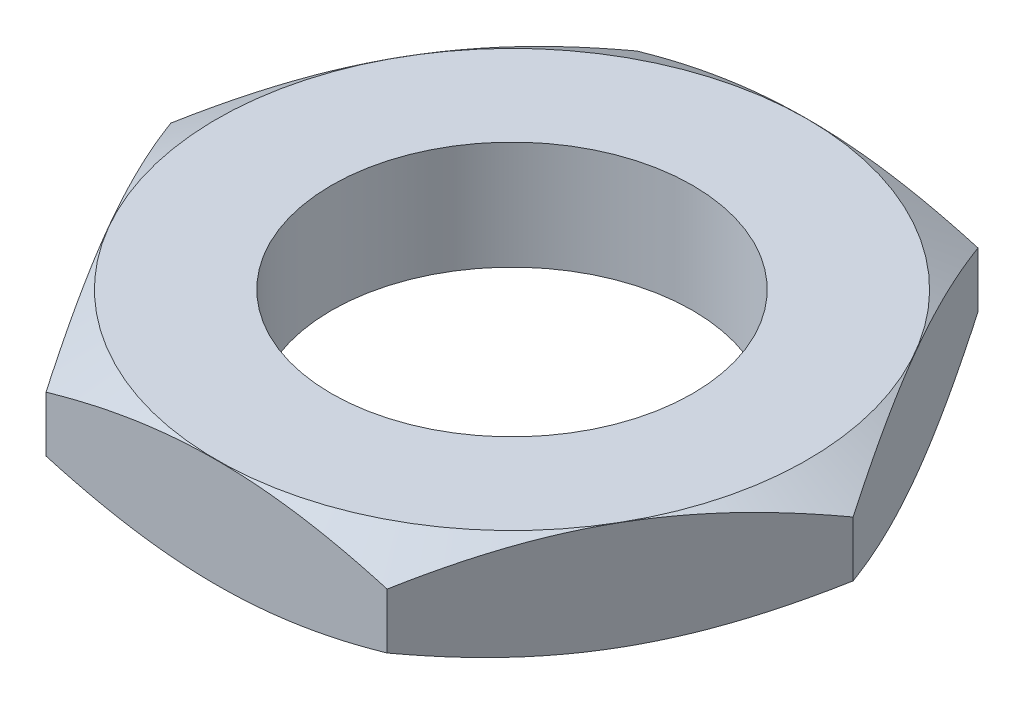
ISO-10303-21;
HEADER;
FILE_DESCRIPTION(('STEP AP214'),'2;1');
FILE_NAME('part.step','',(''),(''),'','','');
FILE_SCHEMA(('AUTOMOTIVE_DESIGN { 1 0 10303 214 1 1 1 1 }'));
ENDSEC;
DATA;
#1=APPLICATION_CONTEXT('core data for automotive mechanical design processes');
#2=APPLICATION_PROTOCOL_DEFINITION('international standard','automotive_design',2000,#1);
#3=PRODUCT_CONTEXT('',#1,'mechanical');
#4=PRODUCT('Part','Part','',(#3));
#5=PRODUCT_RELATED_PRODUCT_CATEGORY('part','',(#4));
#6=PRODUCT_DEFINITION_FORMATION('','',#4);
#7=PRODUCT_DEFINITION_CONTEXT('part definition',#1,'design');
#8=PRODUCT_DEFINITION('design','',#6,#7);
#9=PRODUCT_DEFINITION_SHAPE('','',#8);
#10=(LENGTH_UNIT() NAMED_UNIT(*) SI_UNIT(.MILLI.,.METRE.));
#11=(NAMED_UNIT(*) PLANE_ANGLE_UNIT() SI_UNIT($,.RADIAN.));
#12=(NAMED_UNIT(*) SI_UNIT($,.STERADIAN.) SOLID_ANGLE_UNIT());
#13=UNCERTAINTY_MEASURE_WITH_UNIT(LENGTH_MEASURE(1.E-05),#10,'distance_accuracy_value','');
#14=(GEOMETRIC_REPRESENTATION_CONTEXT(3) GLOBAL_UNCERTAINTY_ASSIGNED_CONTEXT((#13)) GLOBAL_UNIT_ASSIGNED_CONTEXT((#10,
#11,#12)) REPRESENTATION_CONTEXT('',''));
#15=CARTESIAN_POINT('',(0.,0.,0.));
#16=DIRECTION('',(0.,0.,1.));
#17=DIRECTION('',(1.,0.,0.));
#18=AXIS2_PLACEMENT_3D('',#15,#16,#17);
#19=CARTESIAN_POINT('',(4.725,0.,8.18394006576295));
#20=DIRECTION('',(0.,-1.,0.));
#21=DIRECTION('',(0.,0.,-1.));
#22=AXIS2_PLACEMENT_3D('',#19,#20,#21);
#23=PLANE('',#22);
#24=CARTESIAN_POINT('',(0.,0.,0.));
#25=DIRECTION('',(0.,1.,0.));
#26=DIRECTION('',(0.,0.,1.));
#27=AXIS2_PLACEMENT_3D('',#24,#25,#26);
#28=CIRCLE('',#27,5.);
#29=CARTESIAN_POINT('',(0.,0.,5.));
#30=VERTEX_POINT('',#29);
#31=EDGE_CURVE('E109',#30,#30,#28,.T.);
#32=ORIENTED_EDGE('',*,*,#31,.T.);
#33=EDGE_LOOP('',(#32));
#34=FACE_BOUND('',#33,.T.);
#35=CARTESIAN_POINT('',(0.,0.,0.));
#36=DIRECTION('',(0.,-1.,0.));
#37=DIRECTION('',(0.,0.,-1.));
#38=AXIS2_PLACEMENT_3D('',#35,#36,#37);
#39=CIRCLE('',#38,8.18);
#40=CARTESIAN_POINT('',(0.,0.,-8.18));
#41=VERTEX_POINT('',#40);
#42=EDGE_CURVE('E304',#41,#41,#39,.T.);
#43=ORIENTED_EDGE('',*,*,#42,.T.);
#44=EDGE_LOOP('',(#43));
#45=FACE_BOUND('',#44,.T.);
#46=ADVANCED_FACE('F32',(#34,#45),#23,.T.);
#47=CARTESIAN_POINT('',(4.725,3.,8.18394006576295));
#48=DIRECTION('',(0.,-1.,0.));
#49=DIRECTION('',(0.,0.,-1.));
#50=AXIS2_PLACEMENT_3D('',#47,#48,#49);
#51=PLANE('',#50);
#52=CARTESIAN_POINT('',(0.,3.,0.));
#53=DIRECTION('',(0.,-1.,0.));
#54=DIRECTION('',(0.,0.,-1.));
#55=AXIS2_PLACEMENT_3D('',#52,#53,#54);
#56=CIRCLE('',#55,8.18);
#57=CARTESIAN_POINT('',(0.,3.,-8.18));
#58=VERTEX_POINT('',#57);
#59=EDGE_CURVE('E92',#58,#58,#56,.T.);
#60=ORIENTED_EDGE('',*,*,#59,.F.);
#61=EDGE_LOOP('',(#60));
#62=FACE_BOUND('',#61,.T.);
#63=CARTESIAN_POINT('',(0.,3.,0.));
#64=DIRECTION('',(0.,1.,0.));
#65=DIRECTION('',(0.,0.,1.));
#66=AXIS2_PLACEMENT_3D('',#63,#64,#65);
#67=CIRCLE('',#66,5.);
#68=CARTESIAN_POINT('',(0.,3.,5.));
#69=VERTEX_POINT('',#68);
#70=EDGE_CURVE('E205',#69,#69,#67,.T.);
#71=ORIENTED_EDGE('',*,*,#70,.F.);
#72=EDGE_LOOP('',(#71));
#73=FACE_BOUND('',#72,.T.);
#74=ADVANCED_FACE('F214',(#62,#73),#51,.F.);
#75=CARTESIAN_POINT('',(0.,0.,0.));
#76=DIRECTION('',(0.,1.,0.));
#77=DIRECTION('',(0.,0.,1.));
#78=AXIS2_PLACEMENT_3D('',#75,#76,#77);
#79=CYLINDRICAL_SURFACE('',#78,5.);
#80=ORIENTED_EDGE('',*,*,#31,.F.);
#81=EDGE_LOOP('',(#80));
#82=FACE_BOUND('',#81,.T.);
#83=ORIENTED_EDGE('',*,*,#70,.T.);
#84=EDGE_LOOP('',(#83));
#85=FACE_BOUND('',#84,.T.);
#86=ADVANCED_FACE('F151',(#82,#85),#79,.F.);
#87=CARTESIAN_POINT('',(0.,0.,0.));
#88=DIRECTION('',(0.,1.,0.));
#89=DIRECTION('',(0.,0.,1.));
#90=AXIS2_PLACEMENT_3D('',#87,#88,#89);
#91=CONICAL_SURFACE('',#90,8.18,1.0471975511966);
#92=ORIENTED_EDGE('',*,*,#42,.F.);
#93=EDGE_LOOP('',(#92));
#94=FACE_BOUND('',#93,.T.);
#95=CARTESIAN_POINT('',(9.45011547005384,0.733301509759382,-0.000200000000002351));
#96=CARTESIAN_POINT('',(9.34625480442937,0.673346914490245,0.179691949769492));
#97=CARTESIAN_POINT('',(9.24200690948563,0.616113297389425,0.36025460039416));
#98=CARTESIAN_POINT('',(9.03266449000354,0.507837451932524,0.722846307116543));
#99=CARTESIAN_POINT('',(8.92756962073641,0.456797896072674,0.904875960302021));
#100=CARTESIAN_POINT('',(8.61060232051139,0.313972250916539,1.45387942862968));
#101=CARTESIAN_POINT('',(8.39747867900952,0.232734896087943,1.82302040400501));
#102=CARTESIAN_POINT('',(8.07854326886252,0.137474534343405,2.37543273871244));
#103=CARTESIAN_POINT('',(7.97368430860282,0.110337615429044,2.5570537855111));
#104=CARTESIAN_POINT('',(7.76349218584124,0.0648336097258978,2.92111722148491));
#105=CARTESIAN_POINT('',(7.65815906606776,0.0464657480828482,3.1035595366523));
#106=CARTESIAN_POINT('',(7.44731146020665,0.0189653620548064,3.468758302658));
#107=CARTESIAN_POINT('',(7.3417973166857,0.0098223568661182,3.6515141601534));
#108=CARTESIAN_POINT('',(7.13067155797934,0.000967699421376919,4.01719470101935));
#109=CARTESIAN_POINT('',(7.02505994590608,0.00125575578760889,4.20011937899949));
#110=CARTESIAN_POINT('',(6.82761523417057,0.0106072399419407,4.54210365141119));
#111=CARTESIAN_POINT('',(6.7357682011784,0.0185299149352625,4.70118737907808));
#112=CARTESIAN_POINT('',(6.55228925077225,0.0413544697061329,5.01898224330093));
#113=CARTESIAN_POINT('',(6.46065734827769,0.0562568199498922,5.17769335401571));
#114=CARTESIAN_POINT('',(6.18611638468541,0.111081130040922,5.65321225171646));
#115=CARTESIAN_POINT('',(6.00369328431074,0.161113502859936,5.96917833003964));
#116=CARTESIAN_POINT('',(5.6369119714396,0.286195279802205,6.60446219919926));
#117=CARTESIAN_POINT('',(5.45260056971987,0.361774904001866,6.92369891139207));
#118=CARTESIAN_POINT('',(5.08672633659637,0.533309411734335,7.55741167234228));
#119=CARTESIAN_POINT('',(4.90515881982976,0.62922400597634,7.87189583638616));
#120=CARTESIAN_POINT('',(4.72488452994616,0.733301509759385,8.18414006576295));
#121=B_SPLINE_CURVE_WITH_KNOTS('',3,(#95,#96,#97,#98,#99,#100,#101,#102,#103,#104,#105,#106,
#107,#108,#109,#110,#111,#112,#113,#114,#115,#116,#117,#118,#119,#120),.UNSPECIFIED.,.F.,.F.,(4,
2,2,2,2,2,2,2,2,2,2,2,4),(0.,0.648550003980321,1.29737884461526,2.59773234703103,
3.23198376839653,3.86617913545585,4.49965314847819,5.13310758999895,5.68456465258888,
6.23605889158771,7.33983294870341,8.46808657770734,9.59412536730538),.UNSPECIFIED.);
#122=CARTESIAN_POINT('',(9.45,0.733234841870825,0.));
#123=VERTEX_POINT('',#122);
#124=CARTESIAN_POINT('',(4.725,0.733234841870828,8.18394006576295));
#125=VERTEX_POINT('',#124);
#126=EDGE_CURVE('E56',#123,#125,#121,.T.);
#127=ORIENTED_EDGE('',*,*,#126,.T.);
#128=CARTESIAN_POINT('',(-12.5753497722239,3.9397666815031,8.18394006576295));
#129=CARTESIAN_POINT('',(-12.2188659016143,3.76731212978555,8.18394006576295));
#130=CARTESIAN_POINT('',(-11.861551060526,3.59654523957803,8.18394006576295));
#131=CARTESIAN_POINT('',(-11.1448170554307,3.25933838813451,8.18394006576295));
#132=CARTESIAN_POINT('',(-10.7853975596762,3.09289913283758,8.18394006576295));
#133=CARTESIAN_POINT('',(-10.0621033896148,2.76443665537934,8.18394006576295));
#134=CARTESIAN_POINT('',(-9.69821503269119,2.60244345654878,8.18394006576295));
#135=CARTESIAN_POINT('',(-8.96750300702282,2.28524408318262,8.18394006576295));
#136=CARTESIAN_POINT('',(-8.60067948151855,2.13003757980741,8.18394006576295));
#137=CARTESIAN_POINT('',(-7.85212858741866,1.82354589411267,8.18394006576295));
#138=CARTESIAN_POINT('',(-7.47029056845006,1.67252943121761,8.18394006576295));
#139=CARTESIAN_POINT('',(-6.70210533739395,1.38221090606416,8.18394006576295));
#140=CARTESIAN_POINT('',(-6.31575761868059,1.24291017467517,8.18394006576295));
#141=CARTESIAN_POINT('',(-5.53869534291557,0.97976629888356,8.18394006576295));
#142=CARTESIAN_POINT('',(-5.14799185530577,0.855890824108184,8.18394006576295));
#143=CARTESIAN_POINT('',(-4.36099669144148,0.627647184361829,8.18394006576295));
#144=CARTESIAN_POINT('',(-3.96470685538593,0.523272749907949,8.18394006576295));
#145=CARTESIAN_POINT('',(-3.16842594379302,0.339672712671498,8.18394006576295));
#146=CARTESIAN_POINT('',(-2.76846616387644,0.260315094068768,8.18394006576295));
#147=CARTESIAN_POINT('',(-2.16497946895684,0.163533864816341,8.18394006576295));
#148=CARTESIAN_POINT('',(-1.96321030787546,0.134981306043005,8.18394006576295));
#149=CARTESIAN_POINT('',(-1.55870924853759,0.0858570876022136,8.18394006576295));
#150=CARTESIAN_POINT('',(-1.3559774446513,0.065284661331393,8.18394006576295));
#151=CARTESIAN_POINT('',(-0.952419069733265,0.0327825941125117,8.18394006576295));
#152=CARTESIAN_POINT('',(-0.751601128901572,0.0207461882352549,8.18394006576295));
#153=CARTESIAN_POINT('',(-0.349636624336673,0.00516769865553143,8.18394006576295));
#154=CARTESIAN_POINT('',(-0.148490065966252,0.00162547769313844,8.18394006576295));
#155=CARTESIAN_POINT('',(0.253773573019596,0.0031196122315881,8.18394006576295));
#156=CARTESIAN_POINT('',(0.454890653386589,0.00815603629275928,8.18394006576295));
#157=CARTESIAN_POINT('',(0.856737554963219,0.0266866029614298,8.18394006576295));
#158=CARTESIAN_POINT('',(1.05746735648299,0.0401811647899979,8.18394006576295));
#159=CARTESIAN_POINT('',(1.5434798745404,0.0828126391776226,8.18394006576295));
#160=CARTESIAN_POINT('',(1.82839930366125,0.116162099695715,8.18394006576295));
#161=CARTESIAN_POINT('',(2.39604752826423,0.198057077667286,8.18394006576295));
#162=CARTESIAN_POINT('',(2.67877600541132,0.246604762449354,8.18394006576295));
#163=CARTESIAN_POINT('',(3.24179936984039,0.357168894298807,8.18394006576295));
#164=CARTESIAN_POINT('',(3.52209210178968,0.419196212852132,8.18394006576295));
#165=CARTESIAN_POINT('',(4.07982912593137,0.554833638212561,8.18394006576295));
#166=CARTESIAN_POINT('',(4.35727346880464,0.62844353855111,8.18394006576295));
#167=CARTESIAN_POINT('',(4.91532510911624,0.787176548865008,8.18394006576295));
#168=CARTESIAN_POINT('',(5.19587092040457,0.872514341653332,8.18394006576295));
#169=CARTESIAN_POINT('',(5.75419801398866,1.05175395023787,8.18394006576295));
#170=CARTESIAN_POINT('',(6.03197927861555,1.14565582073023,8.18394006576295));
#171=CARTESIAN_POINT('',(6.58491879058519,1.34055497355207,8.18394006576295));
#172=CARTESIAN_POINT('',(6.86007793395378,1.44154972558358,8.18394006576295));
#173=CARTESIAN_POINT('',(7.40813349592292,1.64947142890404,8.18394006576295));
#174=CARTESIAN_POINT('',(7.68102993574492,1.75639832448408,8.18394006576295));
#175=CARTESIAN_POINT('',(8.30213899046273,2.00630638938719,8.18394006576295));
#176=CARTESIAN_POINT('',(8.64970393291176,2.15089439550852,8.18394006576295));
#177=CARTESIAN_POINT('',(9.34206149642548,2.44657896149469,8.18394006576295));
#178=CARTESIAN_POINT('',(9.68685397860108,2.59767584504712,8.18394006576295));
#179=CARTESIAN_POINT('',(10.3741543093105,2.90513511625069,8.18394006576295));
#180=CARTESIAN_POINT('',(10.7166617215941,3.06149847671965,8.18394006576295));
#181=CARTESIAN_POINT('',(11.3996909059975,3.37848001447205,8.18394006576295));
#182=CARTESIAN_POINT('',(11.7402127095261,3.53909812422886,8.18394006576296));
#183=CARTESIAN_POINT('',(12.4198863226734,3.86397153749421,8.18394006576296));
#184=CARTESIAN_POINT('',(12.7590366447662,4.02822994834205,8.18394006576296));
#185=CARTESIAN_POINT('',(13.4359166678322,4.35965060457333,8.18394006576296));
#186=CARTESIAN_POINT('',(13.7736463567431,4.52681287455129,8.18394006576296));
#187=CARTESIAN_POINT('',(14.7850441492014,5.03192181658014,8.18394006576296));
#188=CARTESIAN_POINT('',(15.4569074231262,5.37348409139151,8.18394006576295));
#189=CARTESIAN_POINT('',(16.4357878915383,5.87747532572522,8.18394006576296));
#190=CARTESIAN_POINT('',(16.7442084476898,6.03719546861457,8.18394006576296));
#191=CARTESIAN_POINT('',(17.3603777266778,6.35791500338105,8.18394006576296));
#192=CARTESIAN_POINT('',(17.6681264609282,6.51891437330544,8.18394006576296));
#193=CARTESIAN_POINT('',(18.5905201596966,7.0035885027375,8.18394006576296));
#194=CARTESIAN_POINT('',(19.2042903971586,7.32892780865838,8.18394006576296));
#195=CARTESIAN_POINT('',(20.4286482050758,7.98228636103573,8.18394006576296));
#196=CARTESIAN_POINT('',(21.0392398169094,8.31029804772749,8.18394006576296));
#197=CARTESIAN_POINT('',(22.2589298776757,8.9690153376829,8.18394006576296));
#198=CARTESIAN_POINT('',(22.8680283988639,9.29972080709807,8.18394006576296));
#199=CARTESIAN_POINT('',(23.4765704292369,9.63144067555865,8.18394006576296));
#200=B_SPLINE_CURVE_WITH_KNOTS('',3,(#128,#129,#130,#131,#132,#133,#134,#135,#136,#137,#138,
#139,#140,#141,#142,#143,#144,#145,#146,#147,#148,#149,#150,#151,#152,#153,#154,#155,#156,#157,
#158,#159,#160,#161,#162,#163,#164,#165,#166,#167,#168,#169,#170,#171,#172,#173,#174,#175,#176,
#177,#178,#179,#180,#181,#182,#183,#184,#185,#186,#187,#188,#189,#190,#191,#192,#193,#194,#195,
#196,#197,#198,#199),.UNSPECIFIED.,.F.,.F.,(4,2,2,2,2,2,2,2,2,2,2,2,2,2,2,2,2,2,2,2,2,2,2,2,2,2,
2,2,2,2,2,2,2,2,2,4),(0.,1.1880352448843,2.37626308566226,3.57115900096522,4.76599695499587,
5.99769859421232,7.22953996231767,8.45875438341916,9.68757293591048,10.9097939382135,
11.5209990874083,12.1321455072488,12.7355063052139,13.3388573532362,13.9422132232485,
14.5455990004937,15.4057140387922,16.2659517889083,17.1268859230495,17.9878047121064,
18.8673545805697,19.7469100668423,20.626153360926,21.5053883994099,22.6346207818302,
23.7639093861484,24.8934077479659,26.0228881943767,27.1533730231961,28.2838674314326,
30.5449013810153,31.5868714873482,32.6288237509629,34.7128033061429,36.7921529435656,
38.8713998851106),.UNSPECIFIED.);
#201=CARTESIAN_POINT('',(-4.725,0.733234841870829,8.18394006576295));
#202=VERTEX_POINT('',#201);
#203=EDGE_CURVE('E83',#125,#202,#200,.F.);
#204=ORIENTED_EDGE('',*,*,#203,.T.);
#205=CARTESIAN_POINT('',(-4.72488452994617,0.733301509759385,8.18414006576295));
#206=CARTESIAN_POINT('',(-4.82874519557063,0.673346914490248,8.00424811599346));
#207=CARTESIAN_POINT('',(-4.93299309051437,0.616113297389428,7.82368546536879));
#208=CARTESIAN_POINT('',(-5.14233550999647,0.507837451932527,7.46109375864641));
#209=CARTESIAN_POINT('',(-5.2474303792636,0.456797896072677,7.27906410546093));
#210=CARTESIAN_POINT('',(-5.56439767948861,0.313972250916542,6.73006063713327));
#211=CARTESIAN_POINT('',(-5.77752132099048,0.232734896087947,6.36091966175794));
#212=CARTESIAN_POINT('',(-6.09645673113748,0.137474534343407,5.80850732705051));
#213=CARTESIAN_POINT('',(-6.20131569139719,0.110337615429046,5.62688628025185));
#214=CARTESIAN_POINT('',(-6.41150781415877,0.0648336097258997,5.26282284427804));
#215=CARTESIAN_POINT('',(-6.51684093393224,0.0464657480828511,5.08038052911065));
#216=CARTESIAN_POINT('',(-6.72768853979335,0.0189653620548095,4.71518176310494));
#217=CARTESIAN_POINT('',(-6.8332026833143,0.00982235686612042,4.53242590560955));
#218=CARTESIAN_POINT('',(-7.04432844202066,0.000967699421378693,4.1667453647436));
#219=CARTESIAN_POINT('',(-7.14994005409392,0.00125575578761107,3.98382068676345));
#220=CARTESIAN_POINT('',(-7.34738476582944,0.010607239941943,3.64183641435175));
#221=CARTESIAN_POINT('',(-7.43923179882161,0.0185299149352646,3.48275268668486));
#222=CARTESIAN_POINT('',(-7.62271074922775,0.0413544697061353,3.16495782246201));
#223=CARTESIAN_POINT('',(-7.71434265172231,0.0562568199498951,3.00624671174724));
#224=CARTESIAN_POINT('',(-7.98888361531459,0.111081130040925,2.53072781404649));
#225=CARTESIAN_POINT('',(-8.17130671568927,0.161113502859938,2.21476173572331));
#226=CARTESIAN_POINT('',(-8.53808802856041,0.286195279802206,1.57947786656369));
#227=CARTESIAN_POINT('',(-8.72239943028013,0.361774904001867,1.26024115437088));
#228=CARTESIAN_POINT('',(-9.08827366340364,0.533309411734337,0.626528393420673));
#229=CARTESIAN_POINT('',(-9.26984118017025,0.629224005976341,0.312044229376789));
#230=CARTESIAN_POINT('',(-9.45011547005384,0.733301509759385,-0.000200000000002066));
#231=B_SPLINE_CURVE_WITH_KNOTS('',3,(#205,#206,#207,#208,#209,#210,#211,#212,#213,#214,#215,
#216,#217,#218,#219,#220,#221,#222,#223,#224,#225,#226,#227,#228,#229,#230),.UNSPECIFIED.,.F.,
.F.,(4,2,2,2,2,2,2,2,2,2,2,2,4),(0.,0.648550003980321,1.29737884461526,2.59773234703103,
3.23198376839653,3.86617913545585,4.49965314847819,5.13310758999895,5.68456465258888,
6.23605889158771,7.33983294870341,8.46808657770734,9.59412536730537),.UNSPECIFIED.);
#232=CARTESIAN_POINT('',(-9.45,0.733234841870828,0.));
#233=VERTEX_POINT('',#232);
#234=EDGE_CURVE('E86',#202,#233,#231,.T.);
#235=ORIENTED_EDGE('',*,*,#234,.T.);
#236=CARTESIAN_POINT('',(-9.45011547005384,0.733301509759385,0.000199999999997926));
#237=CARTESIAN_POINT('',(-9.34625480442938,0.673346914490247,-0.179691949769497));
#238=CARTESIAN_POINT('',(-9.24200690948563,0.616113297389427,-0.360254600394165));
#239=CARTESIAN_POINT('',(-9.03266449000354,0.507837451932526,-0.722846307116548));
#240=CARTESIAN_POINT('',(-8.92756962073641,0.456797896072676,-0.904875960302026));
#241=CARTESIAN_POINT('',(-8.6106023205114,0.31397225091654,-1.45387942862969));
#242=CARTESIAN_POINT('',(-8.39747867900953,0.232734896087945,-1.82302040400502));
#243=CARTESIAN_POINT('',(-8.07854326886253,0.137474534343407,-2.37543273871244));
#244=CARTESIAN_POINT('',(-7.97368430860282,0.110337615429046,-2.5570537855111));
#245=CARTESIAN_POINT('',(-7.76349218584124,0.0648336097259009,-2.92111722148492));
#246=CARTESIAN_POINT('',(-7.65815906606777,0.0464657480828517,-3.1035595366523));
#247=CARTESIAN_POINT('',(-7.44731146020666,0.0189653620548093,-3.46875830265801));
#248=CARTESIAN_POINT('',(-7.34179731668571,0.00982235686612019,-3.65151416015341));
#249=CARTESIAN_POINT('',(-7.13067155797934,0.000967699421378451,-4.01719470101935));
#250=CARTESIAN_POINT('',(-7.02505994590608,0.00125575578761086,-4.2001193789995));
#251=CARTESIAN_POINT('',(-6.82761523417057,0.010607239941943,-4.5421036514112));
#252=CARTESIAN_POINT('',(-6.7357682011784,0.0185299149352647,-4.70118737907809));
#253=CARTESIAN_POINT('',(-6.55228925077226,0.0413544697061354,-5.01898224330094));
#254=CARTESIAN_POINT('',(-6.4606573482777,0.056256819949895,-5.17769335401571));
#255=CARTESIAN_POINT('',(-6.18611638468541,0.111081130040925,-5.65321225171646));
#256=CARTESIAN_POINT('',(-6.00369328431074,0.161113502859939,-5.96917833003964));
#257=CARTESIAN_POINT('',(-5.6369119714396,0.286195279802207,-6.60446219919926));
#258=CARTESIAN_POINT('',(-5.45260056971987,0.361774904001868,-6.92369891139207));
#259=CARTESIAN_POINT('',(-5.08672633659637,0.533309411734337,-7.55741167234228));
#260=CARTESIAN_POINT('',(-4.90515881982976,0.62922400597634,-7.87189583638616));
#261=CARTESIAN_POINT('',(-4.72488452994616,0.733301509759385,-8.18414006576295));
#262=B_SPLINE_CURVE_WITH_KNOTS('',3,(#236,#237,#238,#239,#240,#241,#242,#243,#244,#245,#246,
#247,#248,#249,#250,#251,#252,#253,#254,#255,#256,#257,#258,#259,#260,#261),.UNSPECIFIED.,.F.,
.F.,(4,2,2,2,2,2,2,2,2,2,2,2,4),(0.,0.648550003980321,1.29737884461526,2.59773234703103,
3.23198376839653,3.86617913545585,4.49965314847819,5.13310758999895,5.68456465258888,
6.2360588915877,7.33983294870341,8.46808657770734,9.59412536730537),.UNSPECIFIED.);
#263=CARTESIAN_POINT('',(-4.725,0.733234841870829,-8.18394006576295));
#264=VERTEX_POINT('',#263);
#265=EDGE_CURVE('E101',#233,#264,#262,.T.);
#266=ORIENTED_EDGE('',*,*,#265,.T.);
#267=CARTESIAN_POINT('',(-12.5753497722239,3.9397666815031,-8.18394006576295));
#268=CARTESIAN_POINT('',(-12.2188659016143,3.76731212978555,-8.18394006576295));
#269=CARTESIAN_POINT('',(-11.861551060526,3.59654523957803,-8.18394006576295));
#270=CARTESIAN_POINT('',(-11.1448170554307,3.25933838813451,-8.18394006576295));
#271=CARTESIAN_POINT('',(-10.7853975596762,3.09289913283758,-8.18394006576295));
#272=CARTESIAN_POINT('',(-10.0621033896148,2.76443665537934,-8.18394006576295));
#273=CARTESIAN_POINT('',(-9.69821503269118,2.60244345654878,-8.18394006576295));
#274=CARTESIAN_POINT('',(-8.96750300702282,2.28524408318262,-8.18394006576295));
#275=CARTESIAN_POINT('',(-8.60067948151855,2.13003757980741,-8.18394006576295));
#276=CARTESIAN_POINT('',(-7.85212858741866,1.82354589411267,-8.18394006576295));
#277=CARTESIAN_POINT('',(-7.47029056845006,1.67252943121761,-8.18394006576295));
#278=CARTESIAN_POINT('',(-6.70210533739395,1.38221090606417,-8.18394006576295));
#279=CARTESIAN_POINT('',(-6.31575761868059,1.24291017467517,-8.18394006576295));
#280=CARTESIAN_POINT('',(-5.53869534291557,0.979766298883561,-8.18394006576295));
#281=CARTESIAN_POINT('',(-5.14799185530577,0.855890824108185,-8.18394006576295));
#282=CARTESIAN_POINT('',(-4.36099669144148,0.627647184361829,-8.18394006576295));
#283=CARTESIAN_POINT('',(-3.96470685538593,0.523272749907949,-8.18394006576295));
#284=CARTESIAN_POINT('',(-3.16842594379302,0.339672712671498,-8.18394006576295));
#285=CARTESIAN_POINT('',(-2.76846616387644,0.260315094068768,-8.18394006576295));
#286=CARTESIAN_POINT('',(-2.16497946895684,0.163533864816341,-8.18394006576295));
#287=CARTESIAN_POINT('',(-1.96321030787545,0.134981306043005,-8.18394006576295));
#288=CARTESIAN_POINT('',(-1.55870924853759,0.0858570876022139,-8.18394006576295));
#289=CARTESIAN_POINT('',(-1.3559774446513,0.0652846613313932,-8.18394006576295));
#290=CARTESIAN_POINT('',(-0.952419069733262,0.032782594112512,-8.18394006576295));
#291=CARTESIAN_POINT('',(-0.751601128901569,0.020746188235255,-8.18394006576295));
#292=CARTESIAN_POINT('',(-0.34963662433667,0.0051676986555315,-8.18394006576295));
#293=CARTESIAN_POINT('',(-0.148490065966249,0.00162547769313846,-8.18394006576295));
#294=CARTESIAN_POINT('',(0.2537735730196,0.00311961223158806,-8.18394006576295));
#295=CARTESIAN_POINT('',(0.454890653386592,0.00815603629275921,-8.18394006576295));
#296=CARTESIAN_POINT('',(0.856737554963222,0.0266866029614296,-8.18394006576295));
#297=CARTESIAN_POINT('',(1.057467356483,0.0401811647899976,-8.18394006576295));
#298=CARTESIAN_POINT('',(1.54347987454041,0.0828126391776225,-8.18394006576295));
#299=CARTESIAN_POINT('',(1.82839930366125,0.116162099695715,-8.18394006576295));
#300=CARTESIAN_POINT('',(2.39604752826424,0.198057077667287,-8.18394006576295));
#301=CARTESIAN_POINT('',(2.67877600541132,0.246604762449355,-8.18394006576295));
#302=CARTESIAN_POINT('',(3.24179936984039,0.357168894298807,-8.18394006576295));
#303=CARTESIAN_POINT('',(3.52209210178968,0.419196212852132,-8.18394006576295));
#304=CARTESIAN_POINT('',(4.07982912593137,0.554833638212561,-8.18394006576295));
#305=CARTESIAN_POINT('',(4.35727346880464,0.62844353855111,-8.18394006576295));
#306=CARTESIAN_POINT('',(4.91532510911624,0.787176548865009,-8.18394006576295));
#307=CARTESIAN_POINT('',(5.19587092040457,0.872514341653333,-8.18394006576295));
#308=CARTESIAN_POINT('',(5.75419801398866,1.05175395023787,-8.18394006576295));
#309=CARTESIAN_POINT('',(6.03197927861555,1.14565582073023,-8.18394006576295));
#310=CARTESIAN_POINT('',(6.58491879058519,1.34055497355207,-8.18394006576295));
#311=CARTESIAN_POINT('',(6.86007793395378,1.44154972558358,-8.18394006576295));
#312=CARTESIAN_POINT('',(7.40813349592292,1.64947142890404,-8.18394006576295));
#313=CARTESIAN_POINT('',(7.68102993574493,1.75639832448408,-8.18394006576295));
#314=CARTESIAN_POINT('',(8.30213899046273,2.00630638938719,-8.18394006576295));
#315=CARTESIAN_POINT('',(8.64970393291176,2.15089439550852,-8.18394006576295));
#316=CARTESIAN_POINT('',(9.34206149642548,2.44657896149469,-8.18394006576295));
#317=CARTESIAN_POINT('',(9.68685397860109,2.59767584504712,-8.18394006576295));
#318=CARTESIAN_POINT('',(10.3741543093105,2.90513511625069,-8.18394006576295));
#319=CARTESIAN_POINT('',(10.7166617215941,3.06149847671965,-8.18394006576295));
#320=CARTESIAN_POINT('',(11.3996909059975,3.37848001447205,-8.18394006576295));
#321=CARTESIAN_POINT('',(11.7402127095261,3.53909812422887,-8.18394006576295));
#322=CARTESIAN_POINT('',(12.4198863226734,3.86397153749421,-8.18394006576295));
#323=CARTESIAN_POINT('',(12.7590366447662,4.02822994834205,-8.18394006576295));
#324=CARTESIAN_POINT('',(13.4359166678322,4.35965060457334,-8.18394006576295));
#325=CARTESIAN_POINT('',(13.7736463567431,4.52681287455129,-8.18394006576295));
#326=CARTESIAN_POINT('',(14.7850441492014,5.03192181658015,-8.18394006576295));
#327=CARTESIAN_POINT('',(15.4569074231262,5.37348409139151,-8.18394006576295));
#328=CARTESIAN_POINT('',(16.4357878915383,5.87747532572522,-8.18394006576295));
#329=CARTESIAN_POINT('',(16.7442084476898,6.03719546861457,-8.18394006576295));
#330=CARTESIAN_POINT('',(17.3603777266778,6.35791500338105,-8.18394006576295));
#331=CARTESIAN_POINT('',(17.6681264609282,6.51891437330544,-8.18394006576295));
#332=CARTESIAN_POINT('',(18.5905201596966,7.0035885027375,-8.18394006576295));
#333=CARTESIAN_POINT('',(19.2042903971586,7.32892780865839,-8.18394006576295));
#334=CARTESIAN_POINT('',(20.4286482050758,7.98228636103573,-8.18394006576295));
#335=CARTESIAN_POINT('',(21.0392398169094,8.31029804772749,-8.18394006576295));
#336=CARTESIAN_POINT('',(22.2589298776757,8.9690153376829,-8.18394006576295));
#337=CARTESIAN_POINT('',(22.8680283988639,9.29972080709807,-8.18394006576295));
#338=CARTESIAN_POINT('',(23.4765704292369,9.63144067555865,-8.18394006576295));
#339=B_SPLINE_CURVE_WITH_KNOTS('',3,(#267,#268,#269,#270,#271,#272,#273,#274,#275,#276,#277,
#278,#279,#280,#281,#282,#283,#284,#285,#286,#287,#288,#289,#290,#291,#292,#293,#294,#295,#296,
#297,#298,#299,#300,#301,#302,#303,#304,#305,#306,#307,#308,#309,#310,#311,#312,#313,#314,#315,
#316,#317,#318,#319,#320,#321,#322,#323,#324,#325,#326,#327,#328,#329,#330,#331,#332,#333,#334,
#335,#336,#337,#338),.UNSPECIFIED.,.F.,.F.,(4,2,2,2,2,2,2,2,2,2,2,2,2,2,2,2,2,2,2,2,2,2,2,2,2,2,
2,2,2,2,2,2,2,2,2,4),(0.,1.1880352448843,2.37626308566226,3.57115900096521,4.76599695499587,
5.99769859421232,7.22953996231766,8.45875438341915,9.68757293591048,10.9097939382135,
11.5209990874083,12.1321455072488,12.7355063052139,13.3388573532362,13.9422132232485,
14.5455990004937,15.4057140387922,16.2659517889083,17.1268859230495,17.9878047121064,
18.8673545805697,19.7469100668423,20.626153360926,21.5053883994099,22.6346207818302,
23.7639093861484,24.8934077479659,26.0228881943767,27.1533730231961,28.2838674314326,
30.5449013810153,31.5868714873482,32.6288237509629,34.7128033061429,36.7921529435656,
38.8713998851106),.UNSPECIFIED.);
#340=CARTESIAN_POINT('',(4.725,0.733234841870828,-8.18394006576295));
#341=VERTEX_POINT('',#340);
#342=EDGE_CURVE('E121',#264,#341,#339,.T.);
#343=ORIENTED_EDGE('',*,*,#342,.T.);
#344=CARTESIAN_POINT('',(4.72488452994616,0.733301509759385,-8.18414006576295));
#345=CARTESIAN_POINT('',(4.82874519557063,0.673346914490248,-8.00424811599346));
#346=CARTESIAN_POINT('',(4.93299309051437,0.616113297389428,-7.82368546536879));
#347=CARTESIAN_POINT('',(5.14233550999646,0.507837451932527,-7.46109375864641));
#348=CARTESIAN_POINT('',(5.24743037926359,0.456797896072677,-7.27906410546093));
#349=CARTESIAN_POINT('',(5.56439767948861,0.313972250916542,-6.73006063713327));
#350=CARTESIAN_POINT('',(5.77752132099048,0.232734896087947,-6.36091966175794));
#351=CARTESIAN_POINT('',(6.09645673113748,0.137474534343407,-5.80850732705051));
#352=CARTESIAN_POINT('',(6.20131569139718,0.110337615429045,-5.62688628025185));
#353=CARTESIAN_POINT('',(6.41150781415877,0.0648336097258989,-5.26282284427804));
#354=CARTESIAN_POINT('',(6.51684093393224,0.0464657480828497,-5.08038052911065));
#355=CARTESIAN_POINT('',(6.72768853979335,0.0189653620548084,-4.71518176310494));
#356=CARTESIAN_POINT('',(6.8332026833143,0.00982235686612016,-4.53242590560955));
#357=CARTESIAN_POINT('',(7.04432844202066,0.000967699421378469,-4.1667453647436));
#358=CARTESIAN_POINT('',(7.14994005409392,0.00125575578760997,-3.98382068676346));
#359=CARTESIAN_POINT('',(7.34738476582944,0.0106072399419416,-3.64183641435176));
#360=CARTESIAN_POINT('',(7.43923179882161,0.0185299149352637,-3.48275268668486));
#361=CARTESIAN_POINT('',(7.62271074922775,0.0413544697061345,-3.16495782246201));
#362=CARTESIAN_POINT('',(7.71434265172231,0.056256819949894,-3.00624671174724));
#363=CARTESIAN_POINT('',(7.98888361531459,0.111081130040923,-2.53072781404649));
#364=CARTESIAN_POINT('',(8.17130671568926,0.161113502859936,-2.21476173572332));
#365=CARTESIAN_POINT('',(8.5380880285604,0.286195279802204,-1.57947786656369));
#366=CARTESIAN_POINT('',(8.72239943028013,0.361774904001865,-1.26024115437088));
#367=CARTESIAN_POINT('',(9.08827366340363,0.533309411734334,-0.626528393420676));
#368=CARTESIAN_POINT('',(9.26984118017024,0.629224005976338,-0.312044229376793));
#369=CARTESIAN_POINT('',(9.45011547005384,0.733301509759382,0.000199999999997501));
#370=B_SPLINE_CURVE_WITH_KNOTS('',3,(#344,#345,#346,#347,#348,#349,#350,#351,#352,#353,#354,
#355,#356,#357,#358,#359,#360,#361,#362,#363,#364,#365,#366,#367,#368,#369),.UNSPECIFIED.,.F.,
.F.,(4,2,2,2,2,2,2,2,2,2,2,2,4),(0.,0.648550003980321,1.29737884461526,2.59773234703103,
3.23198376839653,3.86617913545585,4.4996531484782,5.13310758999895,5.68456465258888,
6.23605889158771,7.33983294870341,8.46808657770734,9.59412536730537),.UNSPECIFIED.);
#371=EDGE_CURVE('E129',#341,#123,#370,.T.);
#372=ORIENTED_EDGE('',*,*,#371,.T.);
#373=EDGE_LOOP('',(#127,#204,#235,#266,#343,#372));
#374=FACE_BOUND('',#373,.T.);
#375=ADVANCED_FACE('F85',(#94,#374),#91,.T.);
#376=CARTESIAN_POINT('',(0.,3.,0.));
#377=DIRECTION('',(0.,-1.,0.));
#378=DIRECTION('',(0.,0.,-1.));
#379=AXIS2_PLACEMENT_3D('',#376,#377,#378);
#380=CONICAL_SURFACE('',#379,8.18,1.0471975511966);
#381=ORIENTED_EDGE('',*,*,#59,.T.);
#382=EDGE_LOOP('',(#381));
#383=FACE_BOUND('',#382,.T.);
#384=CARTESIAN_POINT('',(4.72488452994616,2.26669849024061,-8.18414006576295));
#385=CARTESIAN_POINT('',(4.82874519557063,2.32665308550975,-8.00424811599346));
#386=CARTESIAN_POINT('',(4.93299309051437,2.38388670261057,-7.82368546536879));
#387=CARTESIAN_POINT('',(5.14233550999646,2.49216254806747,-7.46109375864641));
#388=CARTESIAN_POINT('',(5.2474303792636,2.54320210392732,-7.27906410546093));
#389=CARTESIAN_POINT('',(5.56439767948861,2.68602774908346,-6.73006063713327));
#390=CARTESIAN_POINT('',(5.77752132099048,2.76726510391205,-6.36091966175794));
#391=CARTESIAN_POINT('',(6.09645673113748,2.86252546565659,-5.80850732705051));
#392=CARTESIAN_POINT('',(6.20131569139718,2.88966238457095,-5.62688628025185));
#393=CARTESIAN_POINT('',(6.41150781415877,2.9351663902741,-5.26282284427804));
#394=CARTESIAN_POINT('',(6.51684093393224,2.95353425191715,-5.08038052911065));
#395=CARTESIAN_POINT('',(6.72768853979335,2.98103463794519,-4.71518176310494));
#396=CARTESIAN_POINT('',(6.8332026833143,2.99017764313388,-4.53242590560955));
#397=CARTESIAN_POINT('',(7.04432844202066,2.99903230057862,-4.1667453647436));
#398=CARTESIAN_POINT('',(7.14994005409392,2.99874424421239,-3.98382068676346));
#399=CARTESIAN_POINT('',(7.34738476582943,2.98939276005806,-3.64183641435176));
#400=CARTESIAN_POINT('',(7.4392317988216,2.98147008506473,-3.48275268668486));
#401=CARTESIAN_POINT('',(7.62271074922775,2.95864553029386,-3.16495782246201));
#402=CARTESIAN_POINT('',(7.71434265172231,2.94374318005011,-3.00624671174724));
#403=CARTESIAN_POINT('',(7.98888361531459,2.88891886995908,-2.53072781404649));
#404=CARTESIAN_POINT('',(8.17130671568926,2.83888649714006,-2.21476173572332));
#405=CARTESIAN_POINT('',(8.5380880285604,2.71380472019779,-1.57947786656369));
#406=CARTESIAN_POINT('',(8.72239943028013,2.63822509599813,-1.26024115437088));
#407=CARTESIAN_POINT('',(9.08827366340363,2.46669058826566,-0.626528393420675));
#408=CARTESIAN_POINT('',(9.26984118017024,2.37077599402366,-0.312044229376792));
#409=CARTESIAN_POINT('',(9.45011547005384,2.26669849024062,0.000199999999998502));
#410=B_SPLINE_CURVE_WITH_KNOTS('',3,(#384,#385,#386,#387,#388,#389,#390,#391,#392,#393,#394,
#395,#396,#397,#398,#399,#400,#401,#402,#403,#404,#405,#406,#407,#408,#409),.UNSPECIFIED.,.F.,
.F.,(4,2,2,2,2,2,2,2,2,2,2,2,4),(0.,0.64855000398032,1.29737884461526,2.59773234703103,
3.23198376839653,3.86617913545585,4.49965314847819,5.13310758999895,5.68456465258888,
6.23605889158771,7.33983294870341,8.46808657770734,9.59412536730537),.UNSPECIFIED.);
#411=CARTESIAN_POINT('',(4.725,2.26676515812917,-8.18394006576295));
#412=VERTEX_POINT('',#411);
#413=CARTESIAN_POINT('',(9.45,2.26676515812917,0.));
#414=VERTEX_POINT('',#413);
#415=EDGE_CURVE('E127',#412,#414,#410,.T.);
#416=ORIENTED_EDGE('',*,*,#415,.F.);
#417=CARTESIAN_POINT('',(-12.5696647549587,-0.937015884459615,-8.18394006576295));
#418=CARTESIAN_POINT('',(-12.2132264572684,-0.764606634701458,-8.18394006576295));
#419=CARTESIAN_POINT('',(-11.8559566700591,-0.59388629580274,-8.18394006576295));
#420=CARTESIAN_POINT('',(-11.1393114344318,-0.256775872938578,-8.18394006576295));
#421=CARTESIAN_POINT('',(-10.779935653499,-0.0903864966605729,-8.18394006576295));
#422=CARTESIAN_POINT('',(-10.0567247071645,0.23797305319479,-8.18394006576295));
#423=CARTESIAN_POINT('',(-9.69287583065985,0.399913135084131,-8.18394006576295));
#424=CARTESIAN_POINT('',(-8.9622410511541,0.717000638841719,-8.18394006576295));
#425=CARTESIAN_POINT('',(-8.59545529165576,0.872148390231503,-8.18394006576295));
#426=CARTESIAN_POINT('',(-7.8470032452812,1.17850356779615,-8.18394006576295));
#427=CARTESIAN_POINT('',(-7.46522648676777,1.32944262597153,-8.18394006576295));
#428=CARTESIAN_POINT('',(-6.69716241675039,1.61959816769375,-8.18394006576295));
#429=CARTESIAN_POINT('',(-6.31087459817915,1.75881331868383,-8.18394006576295));
#430=CARTESIAN_POINT('',(-5.53393266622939,2.02177591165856,-8.18394006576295));
#431=CARTESIAN_POINT('',(-5.14328964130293,2.1455557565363,-8.18394006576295));
#432=CARTESIAN_POINT('',(-4.35641646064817,2.37359737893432,-8.18394006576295));
#433=CARTESIAN_POINT('',(-3.96018814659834,2.47786543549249,-8.18394006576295));
#434=CARTESIAN_POINT('',(-3.16402940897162,2.66124439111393,-8.18394006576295));
#435=CARTESIAN_POINT('',(-2.76413019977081,2.74048709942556,-8.18394006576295));
#436=CARTESIAN_POINT('',(-2.16073965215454,2.83709171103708,-8.18394006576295));
#437=CARTESIAN_POINT('',(-1.95900337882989,2.86558468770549,-8.18394006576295));
#438=CARTESIAN_POINT('',(-1.55457024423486,2.91458938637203,-8.18394006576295));
#439=CARTESIAN_POINT('',(-1.35187347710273,2.93510187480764,-8.18394006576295));
#440=CARTESIAN_POINT('',(-0.94838427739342,2.96748593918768,-8.18394006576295));
#441=CARTESIAN_POINT('',(-0.747600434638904,2.97946415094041,-8.18394006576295));
#442=CARTESIAN_POINT('',(-0.345706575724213,2.99492823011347,-8.18394006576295));
#443=CARTESIAN_POINT('',(-0.144596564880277,2.99841423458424,-8.18394006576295));
#444=CARTESIAN_POINT('',(0.257591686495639,2.99681098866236,-8.18394006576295));
#445=CARTESIAN_POINT('',(0.458669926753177,2.99172166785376,-8.18394006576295));
#446=CARTESIAN_POINT('',(0.860437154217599,2.97308980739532,-8.18394006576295));
#447=CARTESIAN_POINT('',(1.06112612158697,2.95954684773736,-8.18394006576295));
#448=CARTESIAN_POINT('',(1.54721800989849,2.91678865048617,-8.18394006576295));
#449=CARTESIAN_POINT('',(1.83225594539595,2.88335317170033,-8.18394006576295));
#450=CARTESIAN_POINT('',(2.40013647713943,2.80128023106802,-8.18394006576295));
#451=CARTESIAN_POINT('',(2.68297875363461,2.75264059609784,-8.18394006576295));
#452=CARTESIAN_POINT('',(3.24622622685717,2.64188992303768,-8.18394006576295));
#453=CARTESIAN_POINT('',(3.52662926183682,2.57976799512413,-8.18394006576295));
#454=CARTESIAN_POINT('',(4.08458397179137,2.44394124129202,-8.18394006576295));
#455=CARTESIAN_POINT('',(4.36213569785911,2.37023662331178,-8.18394006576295));
#456=CARTESIAN_POINT('',(4.92039864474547,2.21131460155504,-8.18394006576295));
#457=CARTESIAN_POINT('',(5.20104837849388,2.12588268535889,-8.18394006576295));
#458=CARTESIAN_POINT('',(5.75958227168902,1.94645726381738,-8.18394006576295));
#459=CARTESIAN_POINT('',(6.03746641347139,1.85246370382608,-8.18394006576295));
#460=CARTESIAN_POINT('',(6.59061090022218,1.65738398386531,-8.18394006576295));
#461=CARTESIAN_POINT('',(6.86587214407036,1.5563003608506,-8.18394006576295));
#462=CARTESIAN_POINT('',(7.41413188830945,1.348203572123,-8.18394006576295));
#463=CARTESIAN_POINT('',(7.68713040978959,1.24119046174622,-8.18394006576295));
#464=CARTESIAN_POINT('',(8.30784563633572,0.991340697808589,-8.18394006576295));
#465=CARTESIAN_POINT('',(8.65492062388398,0.846912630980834,-8.18394006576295));
#466=CARTESIAN_POINT('',(9.3463079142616,0.551572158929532,-8.18394006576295));
#467=CARTESIAN_POINT('',(9.69062007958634,0.400659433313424,-8.18394006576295));
#468=CARTESIAN_POINT('',(10.3769669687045,0.0935864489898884,-8.18394006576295));
#469=CARTESIAN_POINT('',(10.7190012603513,-0.0625747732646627,-8.18394006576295));
#470=CARTESIAN_POINT('',(11.401090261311,-0.379138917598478,-8.18394006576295));
#471=CARTESIAN_POINT('',(11.7411450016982,-0.539541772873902,-8.18394006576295));
#472=CARTESIAN_POINT('',(12.419887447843,-0.863974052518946,-8.18394006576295));
#473=CARTESIAN_POINT('',(12.7585736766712,-1.02800656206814,-8.18394006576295));
#474=CARTESIAN_POINT('',(13.4345291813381,-1.35896797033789,-8.18394006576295));
#475=CARTESIAN_POINT('',(13.7717984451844,-1.52589689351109,-8.18394006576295));
#476=CARTESIAN_POINT('',(14.7818191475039,-2.03029737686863,-8.18394006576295));
#477=CARTESIAN_POINT('',(15.452770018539,-2.37137615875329,-8.18394006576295));
#478=CARTESIAN_POINT('',(16.4303773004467,-2.8746795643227,-8.18394006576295));
#479=CARTESIAN_POINT('',(16.7384341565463,-3.03420080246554,-8.18394006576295));
#480=CARTESIAN_POINT('',(17.353877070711,-3.35452067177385,-8.18394006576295));
#481=CARTESIAN_POINT('',(17.6612631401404,-3.51531928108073,-8.18394006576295));
#482=CARTESIAN_POINT('',(18.5825699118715,-3.99938885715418,-8.18394006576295));
#483=CARTESIAN_POINT('',(19.1956171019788,-4.32432217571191,-8.18394006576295));
#484=CARTESIAN_POINT('',(20.418537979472,-4.97686882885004,-8.18394006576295));
#485=CARTESIAN_POINT('',(21.0284156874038,-5.30447464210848,-8.18394006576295));
#486=CARTESIAN_POINT('',(22.2466795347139,-5.96237777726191,-8.18394006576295));
#487=CARTESIAN_POINT('',(22.855065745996,-6.29267496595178,-8.18394006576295));
#488=CARTESIAN_POINT('',(23.4628958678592,-6.62398589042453,-8.18394006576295));
#489=B_SPLINE_CURVE_WITH_KNOTS('',3,(#417,#418,#419,#420,#421,#422,#423,#424,#425,#426,#427,
#428,#429,#430,#431,#432,#433,#434,#435,#436,#437,#438,#439,#440,#441,#442,#443,#444,#445,#446,
#447,#448,#449,#450,#451,#452,#453,#454,#455,#456,#457,#458,#459,#460,#461,#462,#463,#464,#465,
#466,#467,#468,#469,#470,#471,#472,#473,#474,#475,#476,#477,#478,#479,#480,#481,#482,#483,#484,
#485,#486,#487,#488),.UNSPECIFIED.,.F.,.F.,(4,2,2,2,2,2,2,2,2,2,2,2,2,2,2,2,2,2,2,2,2,2,2,2,2,2,
2,2,2,2,2,2,2,2,2,4),(0.,1.18785301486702,2.37589892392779,3.57062173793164,4.76528652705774,
5.99673164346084,7.22831653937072,8.45727084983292,9.68582899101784,10.9078039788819,
11.5188863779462,12.1299100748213,12.7331583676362,13.3363969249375,13.9396404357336,
14.5429139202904,15.4034117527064,16.2640326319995,17.1253512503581,17.986654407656,
18.8665848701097,19.746520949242,20.6261437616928,21.5057583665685,22.6334499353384,
23.7611972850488,24.8891528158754,26.0170905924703,27.1460270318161,28.2749730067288,
30.5329098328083,31.573636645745,32.6143456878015,34.6958383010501,36.7727250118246,
38.8495095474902),.UNSPECIFIED.);
#490=CARTESIAN_POINT('',(-4.725,2.26676515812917,-8.18394006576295));
#491=VERTEX_POINT('',#490);
#492=EDGE_CURVE('E122',#491,#412,#489,.T.);
#493=ORIENTED_EDGE('',*,*,#492,.F.);
#494=CARTESIAN_POINT('',(-9.45011547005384,2.26669849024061,0.000199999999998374));
#495=CARTESIAN_POINT('',(-9.34625480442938,2.32665308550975,-0.179691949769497));
#496=CARTESIAN_POINT('',(-9.24200690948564,2.38388670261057,-0.360254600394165));
#497=CARTESIAN_POINT('',(-9.03266449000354,2.49216254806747,-0.722846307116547));
#498=CARTESIAN_POINT('',(-8.92756962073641,2.54320210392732,-0.904875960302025));
#499=CARTESIAN_POINT('',(-8.6106023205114,2.68602774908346,-1.45387942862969));
#500=CARTESIAN_POINT('',(-8.39747867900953,2.76726510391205,-1.82302040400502));
#501=CARTESIAN_POINT('',(-8.07854326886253,2.86252546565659,-2.37543273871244));
#502=CARTESIAN_POINT('',(-7.97368430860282,2.88966238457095,-2.5570537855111));
#503=CARTESIAN_POINT('',(-7.76349218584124,2.9351663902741,-2.92111722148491));
#504=CARTESIAN_POINT('',(-7.65815906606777,2.95353425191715,-3.1035595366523));
#505=CARTESIAN_POINT('',(-7.44731146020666,2.98103463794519,-3.46875830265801));
#506=CARTESIAN_POINT('',(-7.34179731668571,2.99017764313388,-3.6515141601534));
#507=CARTESIAN_POINT('',(-7.13067155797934,2.99903230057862,-4.01719470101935));
#508=CARTESIAN_POINT('',(-7.02505994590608,2.99874424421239,-4.2001193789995));
#509=CARTESIAN_POINT('',(-6.82761523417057,2.98939276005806,-4.5421036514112));
#510=CARTESIAN_POINT('',(-6.7357682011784,2.98147008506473,-4.70118737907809));
#511=CARTESIAN_POINT('',(-6.55228925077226,2.95864553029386,-5.01898224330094));
#512=CARTESIAN_POINT('',(-6.4606573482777,2.9437431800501,-5.17769335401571));
#513=CARTESIAN_POINT('',(-6.18611638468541,2.88891886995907,-5.65321225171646));
#514=CARTESIAN_POINT('',(-6.00369328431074,2.83888649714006,-5.96917833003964));
#515=CARTESIAN_POINT('',(-5.6369119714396,2.71380472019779,-6.60446219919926));
#516=CARTESIAN_POINT('',(-5.45260056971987,2.63822509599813,-6.92369891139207));
#517=CARTESIAN_POINT('',(-5.08672633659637,2.46669058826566,-7.55741167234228));
#518=CARTESIAN_POINT('',(-4.90515881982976,2.37077599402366,-7.87189583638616));
#519=CARTESIAN_POINT('',(-4.72488452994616,2.26669849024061,-8.18414006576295));
#520=B_SPLINE_CURVE_WITH_KNOTS('',3,(#494,#495,#496,#497,#498,#499,#500,#501,#502,#503,#504,
#505,#506,#507,#508,#509,#510,#511,#512,#513,#514,#515,#516,#517,#518,#519),.UNSPECIFIED.,.F.,
.F.,(4,2,2,2,2,2,2,2,2,2,2,2,4),(0.,0.64855000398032,1.29737884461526,2.59773234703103,
3.23198376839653,3.86617913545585,4.49965314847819,5.13310758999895,5.68456465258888,
6.23605889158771,7.33983294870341,8.46808657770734,9.59412536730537),.UNSPECIFIED.);
#521=CARTESIAN_POINT('',(-9.45,2.26676515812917,0.));
#522=VERTEX_POINT('',#521);
#523=EDGE_CURVE('E181',#522,#491,#520,.T.);
#524=ORIENTED_EDGE('',*,*,#523,.F.);
#525=CARTESIAN_POINT('',(-4.72488452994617,2.26669849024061,8.18414006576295));
#526=CARTESIAN_POINT('',(-4.82874519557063,2.32665308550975,8.00424811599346));
#527=CARTESIAN_POINT('',(-4.93299309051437,2.38388670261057,7.82368546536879));
#528=CARTESIAN_POINT('',(-5.14233550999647,2.49216254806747,7.46109375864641));
#529=CARTESIAN_POINT('',(-5.2474303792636,2.54320210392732,7.27906410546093));
#530=CARTESIAN_POINT('',(-5.56439767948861,2.68602774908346,6.73006063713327));
#531=CARTESIAN_POINT('',(-5.77752132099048,2.76726510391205,6.36091966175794));
#532=CARTESIAN_POINT('',(-6.09645673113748,2.86252546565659,5.80850732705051));
#533=CARTESIAN_POINT('',(-6.20131569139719,2.88966238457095,5.62688628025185));
#534=CARTESIAN_POINT('',(-6.41150781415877,2.9351663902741,5.26282284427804));
#535=CARTESIAN_POINT('',(-6.51684093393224,2.95353425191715,5.08038052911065));
#536=CARTESIAN_POINT('',(-6.72768853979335,2.98103463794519,4.71518176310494));
#537=CARTESIAN_POINT('',(-6.8332026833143,2.99017764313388,4.53242590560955));
#538=CARTESIAN_POINT('',(-7.04432844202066,2.99903230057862,4.1667453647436));
#539=CARTESIAN_POINT('',(-7.14994005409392,2.99874424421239,3.98382068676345));
#540=CARTESIAN_POINT('',(-7.34738476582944,2.98939276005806,3.64183641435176));
#541=CARTESIAN_POINT('',(-7.43923179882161,2.98147008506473,3.48275268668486));
#542=CARTESIAN_POINT('',(-7.62271074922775,2.95864553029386,3.16495782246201));
#543=CARTESIAN_POINT('',(-7.71434265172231,2.9437431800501,3.00624671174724));
#544=CARTESIAN_POINT('',(-7.98888361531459,2.88891886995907,2.53072781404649));
#545=CARTESIAN_POINT('',(-8.17130671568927,2.83888649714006,2.21476173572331));
#546=CARTESIAN_POINT('',(-8.53808802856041,2.71380472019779,1.57947786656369));
#547=CARTESIAN_POINT('',(-8.72239943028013,2.63822509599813,1.26024115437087));
#548=CARTESIAN_POINT('',(-9.08827366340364,2.46669058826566,0.626528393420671));
#549=CARTESIAN_POINT('',(-9.26984118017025,2.37077599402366,0.312044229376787));
#550=CARTESIAN_POINT('',(-9.45011547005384,2.26669849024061,-0.000200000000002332));
#551=B_SPLINE_CURVE_WITH_KNOTS('',3,(#525,#526,#527,#528,#529,#530,#531,#532,#533,#534,#535,
#536,#537,#538,#539,#540,#541,#542,#543,#544,#545,#546,#547,#548,#549,#550),.UNSPECIFIED.,.F.,
.F.,(4,2,2,2,2,2,2,2,2,2,2,2,4),(0.,0.648550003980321,1.29737884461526,2.59773234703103,
3.23198376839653,3.86617913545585,4.49965314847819,5.13310758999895,5.68456465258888,
6.23605889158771,7.33983294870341,8.46808657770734,9.59412536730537),.UNSPECIFIED.);
#552=CARTESIAN_POINT('',(-4.725,2.26676515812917,8.18394006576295));
#553=VERTEX_POINT('',#552);
#554=EDGE_CURVE('E48',#553,#522,#551,.T.);
#555=ORIENTED_EDGE('',*,*,#554,.F.);
#556=CARTESIAN_POINT('',(-12.5696647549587,-0.937015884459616,8.18394006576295));
#557=CARTESIAN_POINT('',(-12.2132264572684,-0.764606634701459,8.18394006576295));
#558=CARTESIAN_POINT('',(-11.8559566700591,-0.59388629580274,8.18394006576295));
#559=CARTESIAN_POINT('',(-11.1393114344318,-0.256775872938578,8.18394006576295));
#560=CARTESIAN_POINT('',(-10.779935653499,-0.090386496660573,8.18394006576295));
#561=CARTESIAN_POINT('',(-10.0567247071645,0.237973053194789,8.18394006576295));
#562=CARTESIAN_POINT('',(-9.69287583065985,0.399913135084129,8.18394006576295));
#563=CARTESIAN_POINT('',(-8.96224105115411,0.717000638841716,8.18394006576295));
#564=CARTESIAN_POINT('',(-8.59545529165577,0.872148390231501,8.18394006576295));
#565=CARTESIAN_POINT('',(-7.84700324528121,1.17850356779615,8.18394006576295));
#566=CARTESIAN_POINT('',(-7.46522648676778,1.32944262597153,8.18394006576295));
#567=CARTESIAN_POINT('',(-6.6971624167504,1.61959816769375,8.18394006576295));
#568=CARTESIAN_POINT('',(-6.31087459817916,1.75881331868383,8.18394006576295));
#569=CARTESIAN_POINT('',(-5.53393266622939,2.02177591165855,8.18394006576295));
#570=CARTESIAN_POINT('',(-5.14328964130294,2.1455557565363,8.18394006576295));
#571=CARTESIAN_POINT('',(-4.35641646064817,2.37359737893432,8.18394006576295));
#572=CARTESIAN_POINT('',(-3.96018814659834,2.47786543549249,8.18394006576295));
#573=CARTESIAN_POINT('',(-3.16402940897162,2.66124439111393,8.18394006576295));
#574=CARTESIAN_POINT('',(-2.76413019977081,2.74048709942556,8.18394006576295));
#575=CARTESIAN_POINT('',(-2.16073965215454,2.83709171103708,8.18394006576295));
#576=CARTESIAN_POINT('',(-1.95900337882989,2.86558468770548,8.18394006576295));
#577=CARTESIAN_POINT('',(-1.55457024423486,2.91458938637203,8.18394006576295));
#578=CARTESIAN_POINT('',(-1.35187347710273,2.93510187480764,8.18394006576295));
#579=CARTESIAN_POINT('',(-0.948384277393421,2.96748593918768,8.18394006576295));
#580=CARTESIAN_POINT('',(-0.747600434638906,2.97946415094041,8.18394006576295));
#581=CARTESIAN_POINT('',(-0.345706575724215,2.99492823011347,8.18394006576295));
#582=CARTESIAN_POINT('',(-0.144596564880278,2.99841423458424,8.18394006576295));
#583=CARTESIAN_POINT('',(0.257591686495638,2.99681098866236,8.18394006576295));
#584=CARTESIAN_POINT('',(0.458669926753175,2.99172166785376,8.18394006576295));
#585=CARTESIAN_POINT('',(0.860437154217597,2.97308980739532,8.18394006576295));
#586=CARTESIAN_POINT('',(1.06112612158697,2.95954684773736,8.18394006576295));
#587=CARTESIAN_POINT('',(1.54721800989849,2.91678865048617,8.18394006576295));
#588=CARTESIAN_POINT('',(1.83225594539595,2.88335317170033,8.18394006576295));
#589=CARTESIAN_POINT('',(2.40013647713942,2.80128023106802,8.18394006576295));
#590=CARTESIAN_POINT('',(2.68297875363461,2.75264059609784,8.18394006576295));
#591=CARTESIAN_POINT('',(3.24622622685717,2.64188992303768,8.18394006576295));
#592=CARTESIAN_POINT('',(3.52662926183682,2.57976799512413,8.18394006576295));
#593=CARTESIAN_POINT('',(4.08458397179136,2.44394124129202,8.18394006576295));
#594=CARTESIAN_POINT('',(4.36213569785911,2.37023662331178,8.18394006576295));
#595=CARTESIAN_POINT('',(4.92039864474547,2.21131460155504,8.18394006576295));
#596=CARTESIAN_POINT('',(5.20104837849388,2.12588268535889,8.18394006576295));
#597=CARTESIAN_POINT('',(5.75958227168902,1.94645726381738,8.18394006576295));
#598=CARTESIAN_POINT('',(6.03746641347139,1.85246370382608,8.18394006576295));
#599=CARTESIAN_POINT('',(6.59061090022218,1.65738398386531,8.18394006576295));
#600=CARTESIAN_POINT('',(6.86587214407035,1.5563003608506,8.18394006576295));
#601=CARTESIAN_POINT('',(7.41413188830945,1.348203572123,8.18394006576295));
#602=CARTESIAN_POINT('',(7.68713040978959,1.24119046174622,8.18394006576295));
#603=CARTESIAN_POINT('',(8.30784563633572,0.991340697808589,8.18394006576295));
#604=CARTESIAN_POINT('',(8.65492062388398,0.846912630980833,8.18394006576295));
#605=CARTESIAN_POINT('',(9.3463079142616,0.551572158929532,8.18394006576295));
#606=CARTESIAN_POINT('',(9.69062007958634,0.400659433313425,8.18394006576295));
#607=CARTESIAN_POINT('',(10.3769669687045,0.0935864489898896,8.18394006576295));
#608=CARTESIAN_POINT('',(10.7190012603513,-0.0625747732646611,8.18394006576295));
#609=CARTESIAN_POINT('',(11.401090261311,-0.379138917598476,8.18394006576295));
#610=CARTESIAN_POINT('',(11.7411450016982,-0.5395417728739,8.18394006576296));
#611=CARTESIAN_POINT('',(12.419887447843,-0.863974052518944,8.18394006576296));
#612=CARTESIAN_POINT('',(12.7585736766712,-1.02800656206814,8.18394006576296));
#613=CARTESIAN_POINT('',(13.4345291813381,-1.35896797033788,8.18394006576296));
#614=CARTESIAN_POINT('',(13.7717984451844,-1.52589689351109,8.18394006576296));
#615=CARTESIAN_POINT('',(14.7818191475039,-2.03029737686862,8.18394006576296));
#616=CARTESIAN_POINT('',(15.452770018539,-2.37137615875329,8.18394006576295));
#617=CARTESIAN_POINT('',(16.4303773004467,-2.87467956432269,8.18394006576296));
#618=CARTESIAN_POINT('',(16.7384341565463,-3.03420080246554,8.18394006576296));
#619=CARTESIAN_POINT('',(17.353877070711,-3.35452067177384,8.18394006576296));
#620=CARTESIAN_POINT('',(17.6612631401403,-3.51531928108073,8.18394006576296));
#621=CARTESIAN_POINT('',(18.5825699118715,-3.99938885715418,8.18394006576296));
#622=CARTESIAN_POINT('',(19.1956171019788,-4.32432217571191,8.18394006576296));
#623=CARTESIAN_POINT('',(20.418537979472,-4.97686882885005,8.18394006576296));
#624=CARTESIAN_POINT('',(21.0284156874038,-5.30447464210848,8.18394006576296));
#625=CARTESIAN_POINT('',(22.2466795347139,-5.96237777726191,8.18394006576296));
#626=CARTESIAN_POINT('',(22.855065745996,-6.29267496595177,8.18394006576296));
#627=CARTESIAN_POINT('',(23.4628958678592,-6.62398589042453,8.18394006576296));
#628=B_SPLINE_CURVE_WITH_KNOTS('',3,(#556,#557,#558,#559,#560,#561,#562,#563,#564,#565,#566,
#567,#568,#569,#570,#571,#572,#573,#574,#575,#576,#577,#578,#579,#580,#581,#582,#583,#584,#585,
#586,#587,#588,#589,#590,#591,#592,#593,#594,#595,#596,#597,#598,#599,#600,#601,#602,#603,#604,
#605,#606,#607,#608,#609,#610,#611,#612,#613,#614,#615,#616,#617,#618,#619,#620,#621,#622,#623,
#624,#625,#626,#627),.UNSPECIFIED.,.F.,.F.,(4,2,2,2,2,2,2,2,2,2,2,2,2,2,2,2,2,2,2,2,2,2,2,2,2,2,
2,2,2,2,2,2,2,2,2,4),(0.,1.18785301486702,2.37589892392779,3.57062173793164,4.76528652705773,
5.99673164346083,7.22831653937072,8.45727084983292,9.68582899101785,10.9078039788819,
11.5188863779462,12.1299100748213,12.7331583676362,13.3363969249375,13.9396404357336,
14.5429139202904,15.4034117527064,16.2640326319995,17.1253512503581,17.986654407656,
18.8665848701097,19.7465209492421,20.6261437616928,21.5057583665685,22.6334499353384,
23.7611972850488,24.8891528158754,26.0170905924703,27.1460270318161,28.2749730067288,
30.5329098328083,31.573636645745,32.6143456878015,34.6958383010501,36.7727250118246,
38.8495095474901),.UNSPECIFIED.);
#629=CARTESIAN_POINT('',(4.725,2.26676515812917,8.18394006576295));
#630=VERTEX_POINT('',#629);
#631=EDGE_CURVE('E104',#630,#553,#628,.F.);
#632=ORIENTED_EDGE('',*,*,#631,.F.);
#633=CARTESIAN_POINT('',(9.45011547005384,2.26669849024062,-0.000200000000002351));
#634=CARTESIAN_POINT('',(9.34625480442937,2.32665308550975,0.179691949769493));
#635=CARTESIAN_POINT('',(9.24200690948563,2.38388670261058,0.36025460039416));
#636=CARTESIAN_POINT('',(9.03266449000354,2.49216254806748,0.722846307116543));
#637=CARTESIAN_POINT('',(8.92756962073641,2.54320210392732,0.904875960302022));
#638=CARTESIAN_POINT('',(8.61060232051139,2.68602774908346,1.45387942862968));
#639=CARTESIAN_POINT('',(8.39747867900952,2.76726510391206,1.82302040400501));
#640=CARTESIAN_POINT('',(8.07854326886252,2.86252546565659,2.37543273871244));
#641=CARTESIAN_POINT('',(7.97368430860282,2.88966238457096,2.5570537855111));
#642=CARTESIAN_POINT('',(7.76349218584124,2.9351663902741,2.92111722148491));
#643=CARTESIAN_POINT('',(7.65815906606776,2.95353425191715,3.1035595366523));
#644=CARTESIAN_POINT('',(7.44731146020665,2.98103463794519,3.468758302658));
#645=CARTESIAN_POINT('',(7.3417973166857,2.99017764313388,3.6515141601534));
#646=CARTESIAN_POINT('',(7.13067155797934,2.99903230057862,4.01719470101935));
#647=CARTESIAN_POINT('',(7.02505994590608,2.99874424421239,4.20011937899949));
#648=CARTESIAN_POINT('',(6.82761523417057,2.98939276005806,4.54210365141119));
#649=CARTESIAN_POINT('',(6.7357682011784,2.98147008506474,4.70118737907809));
#650=CARTESIAN_POINT('',(6.55228925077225,2.95864553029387,5.01898224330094));
#651=CARTESIAN_POINT('',(6.46065734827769,2.94374318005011,5.17769335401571));
#652=CARTESIAN_POINT('',(6.18611638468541,2.88891886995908,5.65321225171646));
#653=CARTESIAN_POINT('',(6.00369328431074,2.83888649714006,5.96917833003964));
#654=CARTESIAN_POINT('',(5.6369119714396,2.71380472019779,6.60446219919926));
#655=CARTESIAN_POINT('',(5.45260056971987,2.63822509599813,6.92369891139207));
#656=CARTESIAN_POINT('',(5.08672633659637,2.46669058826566,7.55741167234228));
#657=CARTESIAN_POINT('',(4.90515881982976,2.37077599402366,7.87189583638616));
#658=CARTESIAN_POINT('',(4.72488452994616,2.26669849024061,8.18414006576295));
#659=B_SPLINE_CURVE_WITH_KNOTS('',3,(#633,#634,#635,#636,#637,#638,#639,#640,#641,#642,#643,
#644,#645,#646,#647,#648,#649,#650,#651,#652,#653,#654,#655,#656,#657,#658),.UNSPECIFIED.,.F.,
.F.,(4,2,2,2,2,2,2,2,2,2,2,2,4),(0.,0.648550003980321,1.29737884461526,2.59773234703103,
3.23198376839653,3.86617913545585,4.49965314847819,5.13310758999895,5.68456465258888,
6.23605889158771,7.33983294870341,8.46808657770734,9.59412536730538),.UNSPECIFIED.);
#660=EDGE_CURVE('E199',#414,#630,#659,.T.);
#661=ORIENTED_EDGE('',*,*,#660,.F.);
#662=EDGE_LOOP('',(#416,#493,#524,#555,#632,#661));
#663=FACE_BOUND('',#662,.T.);
#664=ADVANCED_FACE('F150',(#383,#663),#380,.T.);
#665=CARTESIAN_POINT('',(-4.725,3.,8.18394006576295));
#666=DIRECTION('',(0.,0.,-1.));
#667=DIRECTION('',(-1.,0.,0.));
#668=AXIS2_PLACEMENT_3D('',#665,#666,#667);
#669=PLANE('',#668);
#670=DIRECTION('',(0.,-1.,0.));
#671=VECTOR('',#670,1.);
#672=CARTESIAN_POINT('',(4.725,3.,8.18394006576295));
#673=LINE('',#672,#671);
#674=EDGE_CURVE('E105',#630,#125,#673,.T.);
#675=ORIENTED_EDGE('',*,*,#674,.F.);
#676=ORIENTED_EDGE('',*,*,#631,.T.);
#677=DIRECTION('',(0.,-1.,0.));
#678=VECTOR('',#677,1.);
#679=CARTESIAN_POINT('',(-4.725,3.,8.18394006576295));
#680=LINE('',#679,#678);
#681=EDGE_CURVE('E98',#553,#202,#680,.T.);
#682=ORIENTED_EDGE('',*,*,#681,.T.);
#683=ORIENTED_EDGE('',*,*,#203,.F.);
#684=EDGE_LOOP('',(#675,#676,#682,#683));
#685=FACE_BOUND('',#684,.T.);
#686=ADVANCED_FACE('F103',(#685),#669,.F.);
#687=CARTESIAN_POINT('',(-9.45,3.,0.));
#688=DIRECTION('',(0.866025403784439,0.,-0.5));
#689=DIRECTION('',(-0.5,0.,-0.866025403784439));
#690=AXIS2_PLACEMENT_3D('',#687,#688,#689);
#691=PLANE('',#690);
#692=ORIENTED_EDGE('',*,*,#681,.F.);
#693=ORIENTED_EDGE('',*,*,#554,.T.);
#694=DIRECTION('',(0.,-1.,0.));
#695=VECTOR('',#694,1.);
#696=CARTESIAN_POINT('',(-9.45,3.,0.));
#697=LINE('',#696,#695);
#698=EDGE_CURVE('E100',#522,#233,#697,.T.);
#699=ORIENTED_EDGE('',*,*,#698,.T.);
#700=ORIENTED_EDGE('',*,*,#234,.F.);
#701=EDGE_LOOP('',(#692,#693,#699,#700));
#702=FACE_BOUND('',#701,.T.);
#703=ADVANCED_FACE('F97',(#702),#691,.F.);
#704=CARTESIAN_POINT('',(-4.725,3.,-8.18394006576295));
#705=DIRECTION('',(0.866025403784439,0.,0.5));
#706=DIRECTION('',(0.5,0.,-0.866025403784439));
#707=AXIS2_PLACEMENT_3D('',#704,#705,#706);
#708=PLANE('',#707);
#709=ORIENTED_EDGE('',*,*,#698,.F.);
#710=ORIENTED_EDGE('',*,*,#523,.T.);
#711=DIRECTION('',(0.,-1.,0.));
#712=VECTOR('',#711,1.);
#713=CARTESIAN_POINT('',(-4.725,3.,-8.18394006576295));
#714=LINE('',#713,#712);
#715=EDGE_CURVE('E107',#491,#264,#714,.T.);
#716=ORIENTED_EDGE('',*,*,#715,.T.);
#717=ORIENTED_EDGE('',*,*,#265,.F.);
#718=EDGE_LOOP('',(#709,#710,#716,#717));
#719=FACE_BOUND('',#718,.T.);
#720=ADVANCED_FACE('F173',(#719),#708,.F.);
#721=CARTESIAN_POINT('',(4.725,3.,-8.18394006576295));
#722=DIRECTION('',(0.,0.,1.));
#723=DIRECTION('',(1.,0.,0.));
#724=AXIS2_PLACEMENT_3D('',#721,#722,#723);
#725=PLANE('',#724);
#726=ORIENTED_EDGE('',*,*,#715,.F.);
#727=ORIENTED_EDGE('',*,*,#492,.T.);
#728=DIRECTION('',(0.,-1.,0.));
#729=VECTOR('',#728,1.);
#730=CARTESIAN_POINT('',(4.725,3.,-8.18394006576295));
#731=LINE('',#730,#729);
#732=EDGE_CURVE('E41',#412,#341,#731,.T.);
#733=ORIENTED_EDGE('',*,*,#732,.T.);
#734=ORIENTED_EDGE('',*,*,#342,.F.);
#735=EDGE_LOOP('',(#726,#727,#733,#734));
#736=FACE_BOUND('',#735,.T.);
#737=ADVANCED_FACE('F120',(#736),#725,.F.);
#738=CARTESIAN_POINT('',(9.45,3.,0.));
#739=DIRECTION('',(-0.866025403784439,0.,0.5));
#740=DIRECTION('',(0.5,0.,0.866025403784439));
#741=AXIS2_PLACEMENT_3D('',#738,#739,#740);
#742=PLANE('',#741);
#743=ORIENTED_EDGE('',*,*,#732,.F.);
#744=ORIENTED_EDGE('',*,*,#415,.T.);
#745=DIRECTION('',(0.,-1.,0.));
#746=VECTOR('',#745,1.);
#747=CARTESIAN_POINT('',(9.45,3.,0.));
#748=LINE('',#747,#746);
#749=EDGE_CURVE('E11',#414,#123,#748,.T.);
#750=ORIENTED_EDGE('',*,*,#749,.T.);
#751=ORIENTED_EDGE('',*,*,#371,.F.);
#752=EDGE_LOOP('',(#743,#744,#750,#751));
#753=FACE_BOUND('',#752,.T.);
#754=ADVANCED_FACE('F126',(#753),#742,.F.);
#755=CARTESIAN_POINT('',(4.725,3.,8.18394006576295));
#756=DIRECTION('',(-0.866025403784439,0.,-0.5));
#757=DIRECTION('',(-0.5,0.,0.866025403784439));
#758=AXIS2_PLACEMENT_3D('',#755,#756,#757);
#759=PLANE('',#758);
#760=ORIENTED_EDGE('',*,*,#749,.F.);
#761=ORIENTED_EDGE('',*,*,#660,.T.);
#762=ORIENTED_EDGE('',*,*,#674,.T.);
#763=ORIENTED_EDGE('',*,*,#126,.F.);
#764=EDGE_LOOP('',(#760,#761,#762,#763));
#765=FACE_BOUND('',#764,.T.);
#766=ADVANCED_FACE('F34',(#765),#759,.F.);
#767=CLOSED_SHELL('',(#46,#74,#86,#375,#664,#686,#703,#720,#737,#754,#766));
#768=MANIFOLD_SOLID_BREP('B2',#767);
#769=ADVANCED_BREP_SHAPE_REPRESENTATION('',(#18,#768),#14);
#770=SHAPE_DEFINITION_REPRESENTATION(#9,#769);
ENDSEC;
END-ISO-10303-21;
